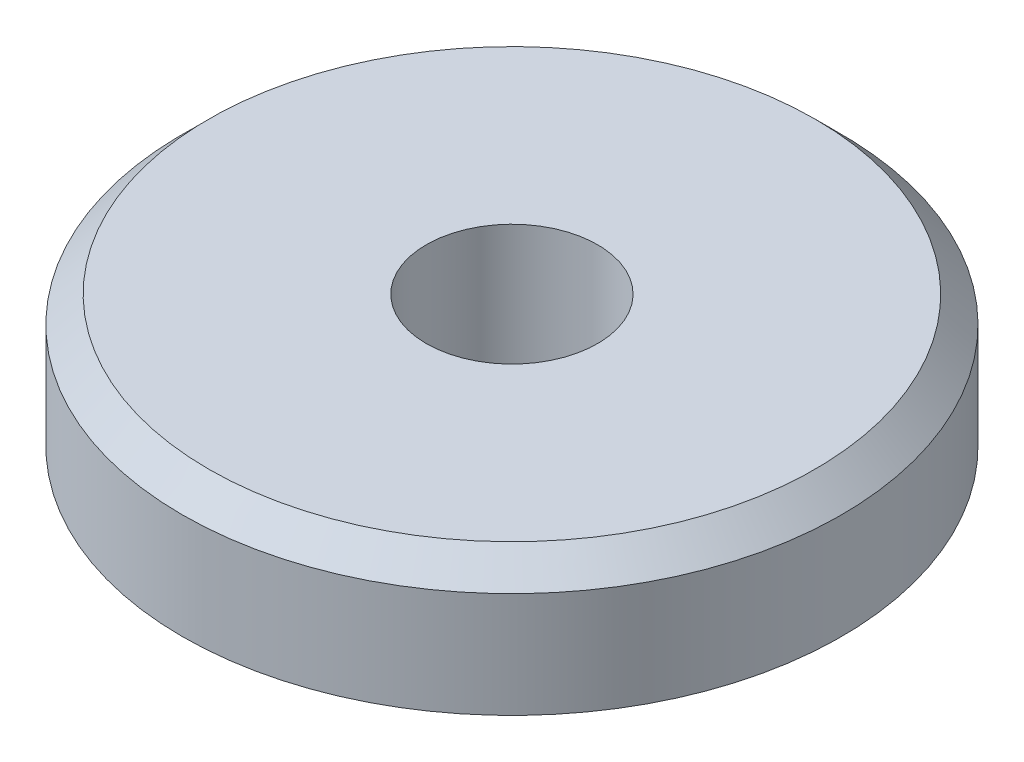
from build123d import *

# Parameters (mm, degrees)
ESQUISSE1_R      = 12.5
ESQUISSE1_R_2    = 3.25
EXTRUSION1_DEPTH = 5
CHANFREIN1_SIZE  = 1


with BuildPart() as part:
    # Esquisse1 → Extrusion1 (new body)
    with BuildSketch(Plane(origin=(0, 0, 0), x_dir=(1, 0, 0), z_dir=(0, 1, 0))):
        with Locations(Location((0, 0, 0), (0, 0, 270))):
            Circle(ESQUISSE1_R)
        with Locations(Location((0, 0, 0), (0, 0, 270))):
            Circle(ESQUISSE1_R_2, mode=Mode.SUBTRACT)
    extrude(amount=EXTRUSION1_DEPTH)

    # Chanfrein1
    chanfrein1_edges = [part.edges().sort_by_distance(p)[0] for p in [
        (0, 5, -12.5),
    ]]
    chamfer(chanfrein1_edges, length=CHANFREIN1_SIZE)


solid = part.part
